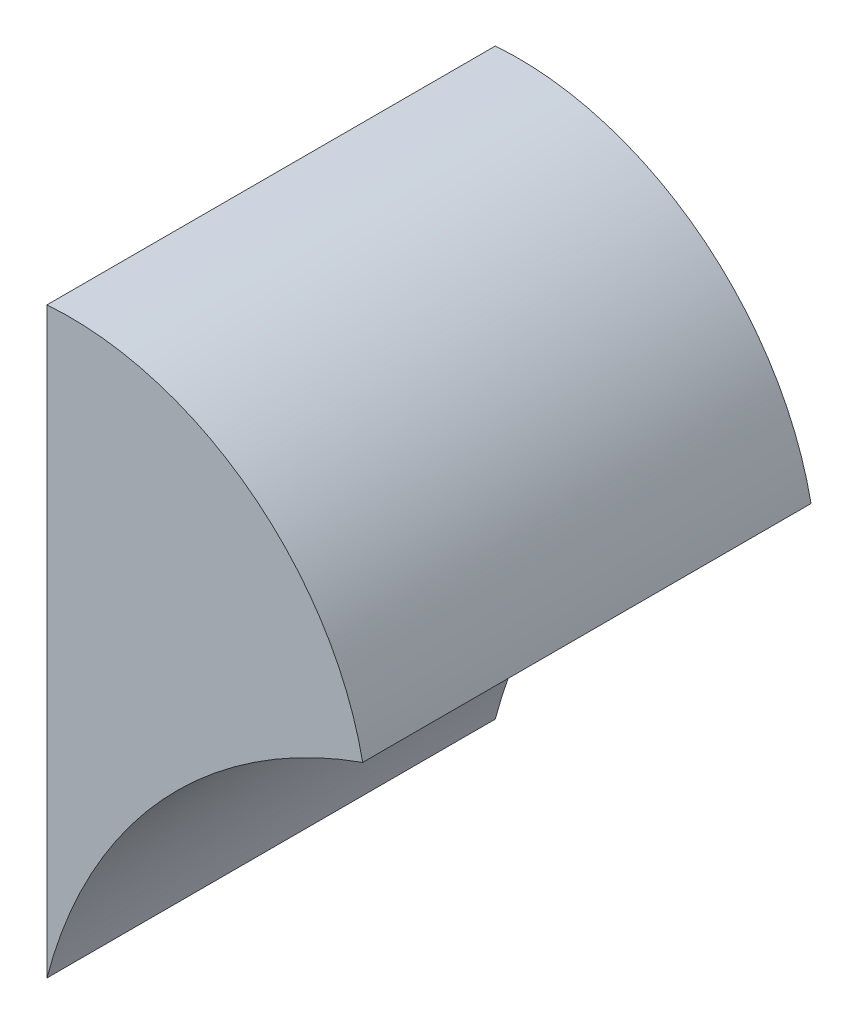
ISO-10303-21;
HEADER;
FILE_DESCRIPTION(('STEP AP214'),'2;1');
FILE_NAME('part.step','',(''),(''),'','','');
FILE_SCHEMA(('AUTOMOTIVE_DESIGN { 1 0 10303 214 1 1 1 1 }'));
ENDSEC;
DATA;
#1=APPLICATION_CONTEXT('core data for automotive mechanical design processes');
#2=APPLICATION_PROTOCOL_DEFINITION('international standard','automotive_design',2000,#1);
#3=PRODUCT_CONTEXT('',#1,'mechanical');
#4=PRODUCT('Part','Part','',(#3));
#5=PRODUCT_RELATED_PRODUCT_CATEGORY('part','',(#4));
#6=PRODUCT_DEFINITION_FORMATION('','',#4);
#7=PRODUCT_DEFINITION_CONTEXT('part definition',#1,'design');
#8=PRODUCT_DEFINITION('design','',#6,#7);
#9=PRODUCT_DEFINITION_SHAPE('','',#8);
#10=(LENGTH_UNIT() NAMED_UNIT(*) SI_UNIT(.MILLI.,.METRE.));
#11=(NAMED_UNIT(*) PLANE_ANGLE_UNIT() SI_UNIT($,.RADIAN.));
#12=(NAMED_UNIT(*) SI_UNIT($,.STERADIAN.) SOLID_ANGLE_UNIT());
#13=UNCERTAINTY_MEASURE_WITH_UNIT(LENGTH_MEASURE(1.E-05),#10,'distance_accuracy_value','');
#14=(GEOMETRIC_REPRESENTATION_CONTEXT(3) GLOBAL_UNCERTAINTY_ASSIGNED_CONTEXT((#13)) GLOBAL_UNIT_ASSIGNED_CONTEXT((#10,
#11,#12)) REPRESENTATION_CONTEXT('',''));
#15=CARTESIAN_POINT('',(0.,0.,0.));
#16=DIRECTION('',(0.,0.,1.));
#17=DIRECTION('',(1.,0.,0.));
#18=AXIS2_PLACEMENT_3D('',#15,#16,#17);
#19=CARTESIAN_POINT('',(-26.2049059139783,-40.8100922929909,-9.));
#20=DIRECTION('',(-1.,0.,0.));
#21=DIRECTION('',(0.,-1.,0.));
#22=AXIS2_PLACEMENT_3D('',#19,#20,#21);
#23=PLANE('',#22);
#24=DIRECTION('',(0.,-1.,0.));
#25=VECTOR('',#24,1.);
#26=CARTESIAN_POINT('',(-26.2049059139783,-40.8100922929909,0.));
#27=LINE('',#26,#25);
#28=CARTESIAN_POINT('',(-26.2049059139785,-24.4638069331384,0.));
#29=VERTEX_POINT('',#28);
#30=CARTESIAN_POINT('',(-26.2049059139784,-36.1653669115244,0.));
#31=VERTEX_POINT('',#30);
#32=EDGE_CURVE('E84',#29,#31,#27,.T.);
#33=ORIENTED_EDGE('',*,*,#32,.F.);
#34=DIRECTION('',(0.,0.,1.));
#35=VECTOR('',#34,1.);
#36=CARTESIAN_POINT('',(-26.2049059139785,-24.4638069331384,-9.));
#37=LINE('',#36,#35);
#38=CARTESIAN_POINT('',(-26.2049059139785,-24.4638069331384,-9.));
#39=VERTEX_POINT('',#38);
#40=EDGE_CURVE('E11',#39,#29,#37,.T.);
#41=ORIENTED_EDGE('',*,*,#40,.F.);
#42=DIRECTION('',(0.,-1.,0.));
#43=VECTOR('',#42,1.);
#44=CARTESIAN_POINT('',(-26.2049059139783,-40.8100922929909,-9.));
#45=LINE('',#44,#43);
#46=CARTESIAN_POINT('',(-26.2049059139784,-36.1653669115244,-9.));
#47=VERTEX_POINT('',#46);
#48=EDGE_CURVE('E76',#39,#47,#45,.T.);
#49=ORIENTED_EDGE('',*,*,#48,.T.);
#50=DIRECTION('',(0.,0.,1.));
#51=VECTOR('',#50,1.);
#52=CARTESIAN_POINT('',(-26.2049059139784,-36.1653669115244,-9.));
#53=LINE('',#52,#51);
#54=EDGE_CURVE('E35',#47,#31,#53,.T.);
#55=ORIENTED_EDGE('',*,*,#54,.T.);
#56=EDGE_LOOP('',(#33,#41,#49,#55));
#57=FACE_BOUND('',#56,.T.);
#58=ADVANCED_FACE('F32',(#57),#23,.T.);
#59=CARTESIAN_POINT('',(-25.7466467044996,-30.4462812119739,-9.));
#60=DIRECTION('',(0.,0.,1.));
#61=DIRECTION('',(1.,0.,0.));
#62=AXIS2_PLACEMENT_3D('',#59,#60,#61);
#63=CYLINDRICAL_SURFACE('',#62,6.);
#64=CARTESIAN_POINT('',(-25.7466467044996,-30.4462812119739,0.));
#65=DIRECTION('',(0.,0.,1.));
#66=DIRECTION('',(1.,0.,0.));
#67=AXIS2_PLACEMENT_3D('',#64,#65,#66);
#68=CIRCLE('',#67,6.);
#69=CARTESIAN_POINT('',(-19.8673321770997,-29.2489255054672,0.));
#70=VERTEX_POINT('',#69);
#71=EDGE_CURVE('E78',#70,#29,#68,.T.);
#72=ORIENTED_EDGE('',*,*,#71,.F.);
#73=DIRECTION('',(0.,0.,1.));
#74=VECTOR('',#73,1.);
#75=CARTESIAN_POINT('',(-19.8673321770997,-29.2489255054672,-9.));
#76=LINE('',#75,#74);
#77=CARTESIAN_POINT('',(-19.8673321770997,-29.2489255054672,-9.));
#78=VERTEX_POINT('',#77);
#79=EDGE_CURVE('E41',#78,#70,#76,.T.);
#80=ORIENTED_EDGE('',*,*,#79,.F.);
#81=CARTESIAN_POINT('',(-25.7466467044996,-30.4462812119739,-9.));
#82=DIRECTION('',(0.,0.,1.));
#83=DIRECTION('',(1.,0.,0.));
#84=AXIS2_PLACEMENT_3D('',#81,#82,#83);
#85=CIRCLE('',#84,6.);
#86=EDGE_CURVE('E73',#78,#39,#85,.T.);
#87=ORIENTED_EDGE('',*,*,#86,.T.);
#88=ORIENTED_EDGE('',*,*,#40,.T.);
#89=EDGE_LOOP('',(#72,#80,#87,#88));
#90=FACE_BOUND('',#89,.T.);
#91=ADVANCED_FACE('F88',(#90),#63,.T.);
#92=CARTESIAN_POINT('',(-16.5245997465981,-38.673687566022,-9.));
#93=DIRECTION('',(0.,0.,1.));
#94=DIRECTION('',(1.,0.,0.));
#95=AXIS2_PLACEMENT_3D('',#92,#93,#94);
#96=CYLINDRICAL_SURFACE('',#95,10.);
#97=CARTESIAN_POINT('',(-16.5245997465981,-38.673687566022,0.));
#98=DIRECTION('',(0.,0.,1.));
#99=DIRECTION('',(1.,0.,0.));
#100=AXIS2_PLACEMENT_3D('',#97,#98,#99);
#101=CIRCLE('',#100,10.);
#102=EDGE_CURVE('E71',#31,#70,#101,.F.);
#103=ORIENTED_EDGE('',*,*,#102,.F.);
#104=ORIENTED_EDGE('',*,*,#54,.F.);
#105=CARTESIAN_POINT('',(-16.5245997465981,-38.673687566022,-9.));
#106=DIRECTION('',(0.,0.,1.));
#107=DIRECTION('',(1.,0.,0.));
#108=AXIS2_PLACEMENT_3D('',#105,#106,#107);
#109=CIRCLE('',#108,10.);
#110=EDGE_CURVE('E69',#47,#78,#109,.F.);
#111=ORIENTED_EDGE('',*,*,#110,.T.);
#112=ORIENTED_EDGE('',*,*,#79,.T.);
#113=EDGE_LOOP('',(#103,#104,#111,#112));
#114=FACE_BOUND('',#113,.T.);
#115=ADVANCED_FACE('F68',(#114),#96,.F.);
#116=CARTESIAN_POINT('',(-23.0361190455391,-40.8100922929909,-9.));
#117=DIRECTION('',(0.,0.,1.));
#118=DIRECTION('',(1.,0.,0.));
#119=AXIS2_PLACEMENT_3D('',#116,#117,#118);
#120=PLANE('',#119);
#121=ORIENTED_EDGE('',*,*,#48,.F.);
#122=ORIENTED_EDGE('',*,*,#86,.F.);
#123=ORIENTED_EDGE('',*,*,#110,.F.);
#124=EDGE_LOOP('',(#121,#122,#123));
#125=FACE_BOUND('',#124,.T.);
#126=ADVANCED_FACE('F75',(#125),#120,.F.);
#127=CARTESIAN_POINT('',(-23.0361190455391,-40.8100922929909,0.));
#128=DIRECTION('',(0.,0.,1.));
#129=DIRECTION('',(1.,0.,0.));
#130=AXIS2_PLACEMENT_3D('',#127,#128,#129);
#131=PLANE('',#130);
#132=ORIENTED_EDGE('',*,*,#32,.T.);
#133=ORIENTED_EDGE('',*,*,#102,.T.);
#134=ORIENTED_EDGE('',*,*,#71,.T.);
#135=EDGE_LOOP('',(#132,#133,#134));
#136=FACE_BOUND('',#135,.T.);
#137=ADVANCED_FACE('F87',(#136),#131,.T.);
#138=CLOSED_SHELL('',(#58,#91,#115,#126,#137));
#139=MANIFOLD_SOLID_BREP('B2',#138);
#140=ADVANCED_BREP_SHAPE_REPRESENTATION('',(#18,#139),#14);
#141=SHAPE_DEFINITION_REPRESENTATION(#9,#140);
ENDSEC;
END-ISO-10303-21;
